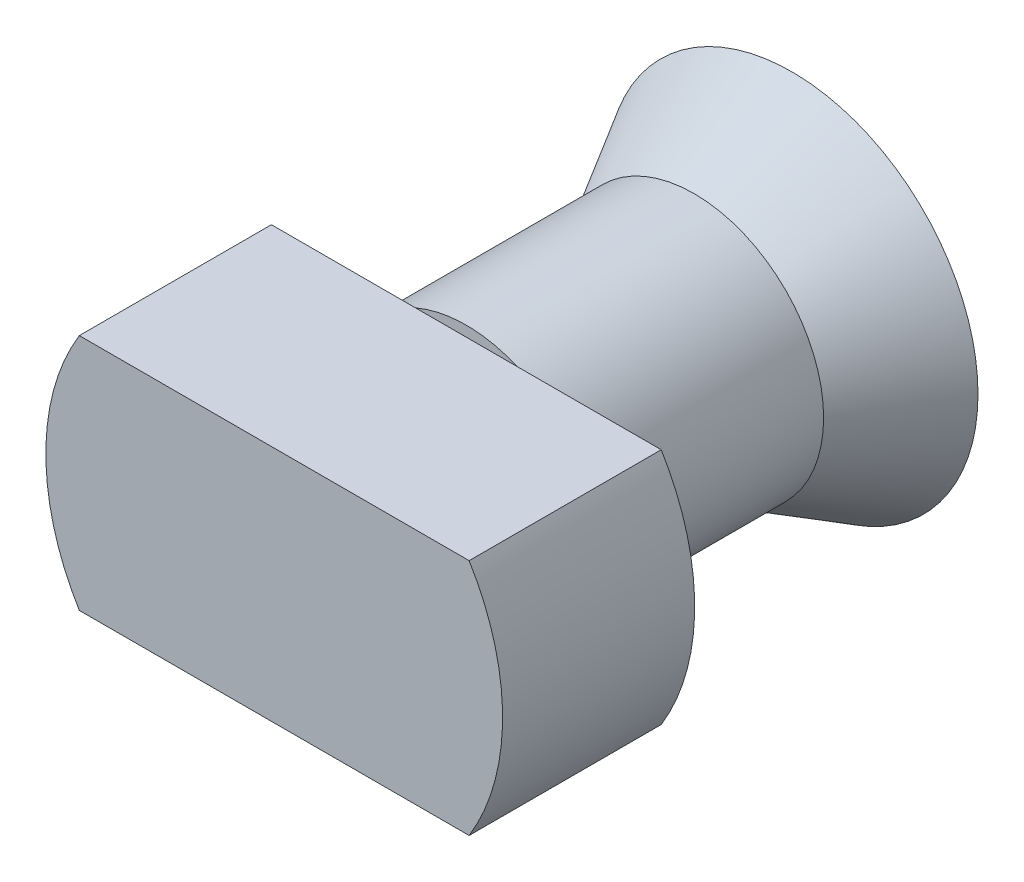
ISO-10303-21;
HEADER;
FILE_DESCRIPTION(('STEP AP214'),'2;1');
FILE_NAME('part.step','',(''),(''),'','','');
FILE_SCHEMA(('AUTOMOTIVE_DESIGN { 1 0 10303 214 1 1 1 1 }'));
ENDSEC;
DATA;
#1=APPLICATION_CONTEXT('core data for automotive mechanical design processes');
#2=APPLICATION_PROTOCOL_DEFINITION('international standard','automotive_design',2000,#1);
#3=PRODUCT_CONTEXT('',#1,'mechanical');
#4=PRODUCT('Part','Part','',(#3));
#5=PRODUCT_RELATED_PRODUCT_CATEGORY('part','',(#4));
#6=PRODUCT_DEFINITION_FORMATION('','',#4);
#7=PRODUCT_DEFINITION_CONTEXT('part definition',#1,'design');
#8=PRODUCT_DEFINITION('design','',#6,#7);
#9=PRODUCT_DEFINITION_SHAPE('','',#8);
#10=(LENGTH_UNIT() NAMED_UNIT(*) SI_UNIT(.MILLI.,.METRE.));
#11=(NAMED_UNIT(*) PLANE_ANGLE_UNIT() SI_UNIT($,.RADIAN.));
#12=(NAMED_UNIT(*) SI_UNIT($,.STERADIAN.) SOLID_ANGLE_UNIT());
#13=UNCERTAINTY_MEASURE_WITH_UNIT(LENGTH_MEASURE(1.E-05),#10,'distance_accuracy_value','');
#14=(GEOMETRIC_REPRESENTATION_CONTEXT(3) GLOBAL_UNCERTAINTY_ASSIGNED_CONTEXT((#13)) GLOBAL_UNIT_ASSIGNED_CONTEXT((#10,
#11,#12)) REPRESENTATION_CONTEXT('',''));
#15=CARTESIAN_POINT('',(0.,0.,0.));
#16=DIRECTION('',(0.,0.,1.));
#17=DIRECTION('',(1.,0.,0.));
#18=AXIS2_PLACEMENT_3D('',#15,#16,#17);
#19=CARTESIAN_POINT('',(0.,0.,0.));
#20=DIRECTION('',(0.,0.,1.));
#21=DIRECTION('',(1.,0.,0.));
#22=AXIS2_PLACEMENT_3D('',#19,#20,#21);
#23=CYLINDRICAL_SURFACE('',#22,2.778125);
#24=CARTESIAN_POINT('',(0.,0.,-2.3368));
#25=DIRECTION('',(0.,0.,1.));
#26=DIRECTION('',(1.,0.,0.));
#27=AXIS2_PLACEMENT_3D('',#24,#25,#26);
#28=CIRCLE('',#27,2.778125);
#29=CARTESIAN_POINT('',(-2.37104484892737,1.4478,-2.3368));
#30=VERTEX_POINT('',#29);
#31=CARTESIAN_POINT('',(-2.37104484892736,-1.4478,-2.3368));
#32=VERTEX_POINT('',#31);
#33=EDGE_CURVE('E109',#30,#32,#28,.T.);
#34=ORIENTED_EDGE('',*,*,#33,.T.);
#35=DIRECTION('',(0.,0.,1.));
#36=VECTOR('',#35,1.);
#37=CARTESIAN_POINT('',(-2.37104484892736,-1.4478,-7.26195779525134));
#38=LINE('',#37,#36);
#39=CARTESIAN_POINT('',(-2.37104484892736,-1.4478,0.));
#40=VERTEX_POINT('',#39);
#41=EDGE_CURVE('E98',#32,#40,#38,.T.);
#42=ORIENTED_EDGE('',*,*,#41,.T.);
#43=CARTESIAN_POINT('',(0.,0.,0.));
#44=DIRECTION('',(0.,0.,1.));
#45=DIRECTION('',(1.,0.,0.));
#46=AXIS2_PLACEMENT_3D('',#43,#44,#45);
#47=CIRCLE('',#46,2.778125);
#48=CARTESIAN_POINT('',(-2.37104484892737,1.4478,0.));
#49=VERTEX_POINT('',#48);
#50=EDGE_CURVE('E11',#49,#40,#47,.T.);
#51=ORIENTED_EDGE('',*,*,#50,.F.);
#52=DIRECTION('',(0.,0.,1.));
#53=VECTOR('',#52,1.);
#54=CARTESIAN_POINT('',(-2.37104484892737,1.4478,-7.26195779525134));
#55=LINE('',#54,#53);
#56=EDGE_CURVE('E129',#30,#49,#55,.T.);
#57=ORIENTED_EDGE('',*,*,#56,.F.);
#58=EDGE_LOOP('',(#34,#42,#51,#57));
#59=FACE_BOUND('',#58,.T.);
#60=ADVANCED_FACE('F35',(#59),#23,.T.);
#61=CARTESIAN_POINT('',(0.,2.778125,-2.3368));
#62=DIRECTION('',(0.,0.,1.));
#63=DIRECTION('',(1.,0.,0.));
#64=AXIS2_PLACEMENT_3D('',#61,#62,#63);
#65=PLANE('',#64);
#66=CARTESIAN_POINT('',(2.37104484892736,-1.4478,-2.3368));
#67=VERTEX_POINT('',#66);
#68=CARTESIAN_POINT('',(2.37104484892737,1.4478,-2.3368));
#69=VERTEX_POINT('',#68);
#70=EDGE_CURVE('E111',#67,#69,#28,.T.);
#71=ORIENTED_EDGE('',*,*,#70,.F.);
#72=DIRECTION('',(1.,0.,0.));
#73=VECTOR('',#72,1.);
#74=CARTESIAN_POINT('',(2.37104484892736,-1.4478,-2.3368));
#75=LINE('',#74,#73);
#76=CARTESIAN_POINT('',(0.619572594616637,-1.4478,-2.3368));
#77=VERTEX_POINT('',#76);
#78=EDGE_CURVE('E94',#77,#67,#75,.T.);
#79=ORIENTED_EDGE('',*,*,#78,.F.);
#80=CARTESIAN_POINT('',(0.,0.,-2.3368));
#81=DIRECTION('',(0.,0.,1.));
#82=DIRECTION('',(1.,0.,0.));
#83=AXIS2_PLACEMENT_3D('',#80,#81,#82);
#84=CIRCLE('',#83,1.5748);
#85=CARTESIAN_POINT('',(0.61957259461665,1.4478,-2.3368));
#86=VERTEX_POINT('',#85);
#87=EDGE_CURVE('E58',#77,#86,#84,.T.);
#88=ORIENTED_EDGE('',*,*,#87,.T.);
#89=DIRECTION('',(-1.,0.,0.));
#90=VECTOR('',#89,1.);
#91=CARTESIAN_POINT('',(-2.37104484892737,1.4478,-2.3368));
#92=LINE('',#91,#90);
#93=EDGE_CURVE('E125',#69,#86,#92,.T.);
#94=ORIENTED_EDGE('',*,*,#93,.F.);
#95=EDGE_LOOP('',(#71,#79,#88,#94));
#96=FACE_BOUND('',#95,.T.);
#97=ADVANCED_FACE('F138',(#96),#65,.F.);
#98=CARTESIAN_POINT('',(0.,0.,0.));
#99=DIRECTION('',(0.,0.,-1.));
#100=DIRECTION('',(-1.,0.,0.));
#101=AXIS2_PLACEMENT_3D('',#98,#99,#100);
#102=PLANE('',#101);
#103=ORIENTED_EDGE('',*,*,#50,.T.);
#104=DIRECTION('',(-1.,0.,0.));
#105=VECTOR('',#104,1.);
#106=CARTESIAN_POINT('',(2.37104484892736,-1.4478,0.));
#107=LINE('',#106,#105);
#108=CARTESIAN_POINT('',(2.37104484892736,-1.4478,0.));
#109=VERTEX_POINT('',#108);
#110=EDGE_CURVE('E92',#109,#40,#107,.T.);
#111=ORIENTED_EDGE('',*,*,#110,.F.);
#112=CARTESIAN_POINT('',(2.37104484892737,1.4478,0.));
#113=VERTEX_POINT('',#112);
#114=EDGE_CURVE('E43',#109,#113,#47,.T.);
#115=ORIENTED_EDGE('',*,*,#114,.T.);
#116=DIRECTION('',(1.,0.,0.));
#117=VECTOR('',#116,1.);
#118=CARTESIAN_POINT('',(-2.37104484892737,1.4478,0.));
#119=LINE('',#118,#117);
#120=EDGE_CURVE('E131',#49,#113,#119,.T.);
#121=ORIENTED_EDGE('',*,*,#120,.F.);
#122=EDGE_LOOP('',(#103,#111,#115,#121));
#123=FACE_BOUND('',#122,.T.);
#124=ADVANCED_FACE('F37',(#123),#102,.F.);
#125=ORIENTED_EDGE('',*,*,#114,.F.);
#126=DIRECTION('',(0.,0.,1.));
#127=VECTOR('',#126,1.);
#128=CARTESIAN_POINT('',(2.37104484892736,-1.4478,-7.26195779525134));
#129=LINE('',#128,#127);
#130=EDGE_CURVE('E89',#67,#109,#129,.T.);
#131=ORIENTED_EDGE('',*,*,#130,.F.);
#132=ORIENTED_EDGE('',*,*,#70,.T.);
#133=DIRECTION('',(0.,0.,1.));
#134=VECTOR('',#133,1.);
#135=CARTESIAN_POINT('',(2.37104484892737,1.4478,-7.26195779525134));
#136=LINE('',#135,#134);
#137=EDGE_CURVE('E108',#69,#113,#136,.T.);
#138=ORIENTED_EDGE('',*,*,#137,.T.);
#139=EDGE_LOOP('',(#125,#131,#132,#138));
#140=FACE_BOUND('',#139,.T.);
#141=ADVANCED_FACE('F106',(#140),#23,.T.);
#142=CARTESIAN_POINT('',(-0.61957259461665,1.4478,-2.3368));
#143=VERTEX_POINT('',#142);
#144=CARTESIAN_POINT('',(-0.619572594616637,-1.4478,-2.3368));
#145=VERTEX_POINT('',#144);
#146=EDGE_CURVE('E118',#143,#145,#84,.T.);
#147=ORIENTED_EDGE('',*,*,#146,.T.);
#148=EDGE_CURVE('E50',#32,#145,#75,.T.);
#149=ORIENTED_EDGE('',*,*,#148,.F.);
#150=ORIENTED_EDGE('',*,*,#33,.F.);
#151=EDGE_CURVE('E128',#143,#30,#92,.T.);
#152=ORIENTED_EDGE('',*,*,#151,.F.);
#153=EDGE_LOOP('',(#147,#149,#150,#152));
#154=FACE_BOUND('',#153,.T.);
#155=ADVANCED_FACE('F148',(#154),#65,.F.);
#156=CARTESIAN_POINT('',(0.,0.,0.));
#157=DIRECTION('',(0.,0.,1.));
#158=DIRECTION('',(1.,0.,0.));
#159=AXIS2_PLACEMENT_3D('',#156,#157,#158);
#160=CYLINDRICAL_SURFACE('',#159,1.5748);
#161=EDGE_CURVE('E115',#86,#143,#84,.T.);
#162=ORIENTED_EDGE('',*,*,#161,.F.);
#163=ORIENTED_EDGE('',*,*,#87,.F.);
#164=EDGE_CURVE('E144',#145,#77,#84,.T.);
#165=ORIENTED_EDGE('',*,*,#164,.F.);
#166=ORIENTED_EDGE('',*,*,#146,.F.);
#167=EDGE_LOOP('',(#162,#163,#165,#166));
#168=FACE_BOUND('',#167,.T.);
#169=CARTESIAN_POINT('',(0.,0.,-5.108575));
#170=DIRECTION('',(0.,0.,1.));
#171=DIRECTION('',(1.,0.,0.));
#172=AXIS2_PLACEMENT_3D('',#169,#170,#171);
#173=CIRCLE('',#172,1.5748);
#174=CARTESIAN_POINT('',(1.5748,0.,-5.108575));
#175=VERTEX_POINT('',#174);
#176=EDGE_CURVE('E119',#175,#175,#173,.T.);
#177=ORIENTED_EDGE('',*,*,#176,.T.);
#178=EDGE_LOOP('',(#177));
#179=FACE_BOUND('',#178,.T.);
#180=ADVANCED_FACE('F141',(#168,#179),#160,.T.);
#181=CARTESIAN_POINT('',(0.,0.,-6.2992));
#182=DIRECTION('',(0.,0.,-1.));
#183=DIRECTION('',(-1.,0.,0.));
#184=AXIS2_PLACEMENT_3D('',#181,#182,#183);
#185=CONICAL_SURFACE('',#184,2.2622076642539,0.5235987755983);
#186=ORIENTED_EDGE('',*,*,#176,.F.);
#187=EDGE_LOOP('',(#186));
#188=FACE_BOUND('',#187,.T.);
#189=CARTESIAN_POINT('',(0.,0.,-6.2992));
#190=DIRECTION('',(0.,0.,1.));
#191=DIRECTION('',(1.,0.,0.));
#192=AXIS2_PLACEMENT_3D('',#189,#190,#191);
#193=CIRCLE('',#192,2.2622076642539);
#194=CARTESIAN_POINT('',(2.2622076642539,0.,-6.2992));
#195=VERTEX_POINT('',#194);
#196=EDGE_CURVE('E122',#195,#195,#193,.T.);
#197=ORIENTED_EDGE('',*,*,#196,.T.);
#198=EDGE_LOOP('',(#197));
#199=FACE_BOUND('',#198,.T.);
#200=ADVANCED_FACE('F164',(#188,#199),#185,.T.);
#201=CARTESIAN_POINT('',(0.,2.2622076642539,-6.2992));
#202=DIRECTION('',(0.,0.,1.));
#203=DIRECTION('',(1.,0.,0.));
#204=AXIS2_PLACEMENT_3D('',#201,#202,#203);
#205=PLANE('',#204);
#206=ORIENTED_EDGE('',*,*,#196,.F.);
#207=EDGE_LOOP('',(#206));
#208=FACE_BOUND('',#207,.T.);
#209=ADVANCED_FACE('F156',(#208),#205,.F.);
#210=CARTESIAN_POINT('',(0.,2.778125,-2.3368));
#211=DIRECTION('',(0.,0.,1.));
#212=DIRECTION('',(1.,0.,0.));
#213=AXIS2_PLACEMENT_3D('',#210,#211,#212);
#214=PLANE('',#213);
#215=ORIENTED_EDGE('',*,*,#161,.T.);
#216=EDGE_CURVE('E127',#86,#143,#92,.T.);
#217=ORIENTED_EDGE('',*,*,#216,.F.);
#218=EDGE_LOOP('',(#215,#217));
#219=FACE_BOUND('',#218,.T.);
#220=ADVANCED_FACE('F154',(#219),#214,.T.);
#221=CARTESIAN_POINT('',(-2.37104484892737,1.4478,-7.26195779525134));
#222=DIRECTION('',(0.,-1.,0.));
#223=DIRECTION('',(0.,0.,-1.));
#224=AXIS2_PLACEMENT_3D('',#221,#222,#223);
#225=PLANE('',#224);
#226=ORIENTED_EDGE('',*,*,#93,.T.);
#227=ORIENTED_EDGE('',*,*,#216,.T.);
#228=ORIENTED_EDGE('',*,*,#151,.T.);
#229=ORIENTED_EDGE('',*,*,#56,.T.);
#230=ORIENTED_EDGE('',*,*,#120,.T.);
#231=ORIENTED_EDGE('',*,*,#137,.F.);
#232=EDGE_LOOP('',(#226,#227,#228,#229,#230,#231));
#233=FACE_BOUND('',#232,.T.);
#234=ADVANCED_FACE('F152',(#233),#225,.F.);
#235=CARTESIAN_POINT('',(0.,2.778125,-2.3368));
#236=DIRECTION('',(0.,0.,1.));
#237=DIRECTION('',(1.,0.,0.));
#238=AXIS2_PLACEMENT_3D('',#235,#236,#237);
#239=PLANE('',#238);
#240=ORIENTED_EDGE('',*,*,#164,.T.);
#241=EDGE_CURVE('E134',#145,#77,#75,.T.);
#242=ORIENTED_EDGE('',*,*,#241,.F.);
#243=EDGE_LOOP('',(#240,#242));
#244=FACE_BOUND('',#243,.T.);
#245=ADVANCED_FACE('F162',(#244),#239,.T.);
#246=CARTESIAN_POINT('',(2.37104484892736,-1.4478,-7.26195779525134));
#247=DIRECTION('',(0.,1.,0.));
#248=DIRECTION('',(0.,0.,1.));
#249=AXIS2_PLACEMENT_3D('',#246,#247,#248);
#250=PLANE('',#249);
#251=ORIENTED_EDGE('',*,*,#148,.T.);
#252=ORIENTED_EDGE('',*,*,#241,.T.);
#253=ORIENTED_EDGE('',*,*,#78,.T.);
#254=ORIENTED_EDGE('',*,*,#130,.T.);
#255=ORIENTED_EDGE('',*,*,#110,.T.);
#256=ORIENTED_EDGE('',*,*,#41,.F.);
#257=EDGE_LOOP('',(#251,#252,#253,#254,#255,#256));
#258=FACE_BOUND('',#257,.T.);
#259=ADVANCED_FACE('F91',(#258),#250,.F.);
#260=CLOSED_SHELL('',(#60,#97,#124,#141,#155,#180,#200,#209,#220,#234,#245,#259));
#261=MANIFOLD_SOLID_BREP('B2',#260);
#262=ADVANCED_BREP_SHAPE_REPRESENTATION('',(#18,#261),#14);
#263=SHAPE_DEFINITION_REPRESENTATION(#9,#262);
ENDSEC;
END-ISO-10303-21;
